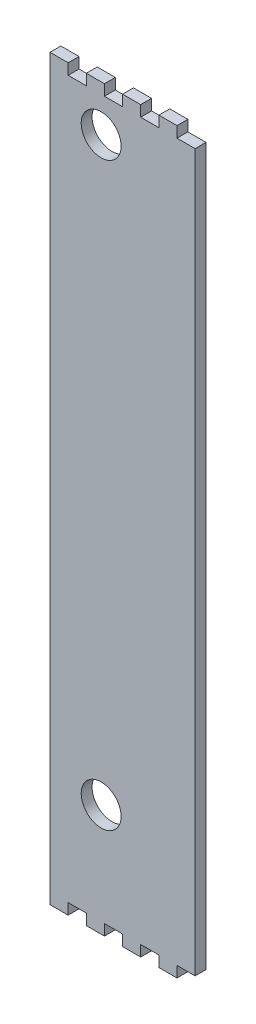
ISO-10303-21;
HEADER;
FILE_DESCRIPTION(('STEP AP214'),'2;1');
FILE_NAME('part.step','',(''),(''),'','','');
FILE_SCHEMA(('AUTOMOTIVE_DESIGN { 1 0 10303 214 1 1 1 1 }'));
ENDSEC;
DATA;
#1=APPLICATION_CONTEXT('core data for automotive mechanical design processes');
#2=APPLICATION_PROTOCOL_DEFINITION('international standard','automotive_design',2000,#1);
#3=PRODUCT_CONTEXT('',#1,'mechanical');
#4=PRODUCT('Part','Part','',(#3));
#5=PRODUCT_RELATED_PRODUCT_CATEGORY('part','',(#4));
#6=PRODUCT_DEFINITION_FORMATION('','',#4);
#7=PRODUCT_DEFINITION_CONTEXT('part definition',#1,'design');
#8=PRODUCT_DEFINITION('design','',#6,#7);
#9=PRODUCT_DEFINITION_SHAPE('','',#8);
#10=(LENGTH_UNIT() NAMED_UNIT(*) SI_UNIT(.MILLI.,.METRE.));
#11=(NAMED_UNIT(*) PLANE_ANGLE_UNIT() SI_UNIT($,.RADIAN.));
#12=(NAMED_UNIT(*) SI_UNIT($,.STERADIAN.) SOLID_ANGLE_UNIT());
#13=UNCERTAINTY_MEASURE_WITH_UNIT(LENGTH_MEASURE(1.E-05),#10,'distance_accuracy_value','');
#14=(GEOMETRIC_REPRESENTATION_CONTEXT(3) GLOBAL_UNCERTAINTY_ASSIGNED_CONTEXT((#13)) GLOBAL_UNIT_ASSIGNED_CONTEXT((#10,
#11,#12)) REPRESENTATION_CONTEXT('',''));
#15=CARTESIAN_POINT('',(0.,0.,0.));
#16=DIRECTION('',(0.,0.,1.));
#17=DIRECTION('',(1.,0.,0.));
#18=AXIS2_PLACEMENT_3D('',#15,#16,#17);
#19=CARTESIAN_POINT('',(-40.,203.5,6.));
#20=DIRECTION('',(1.,0.,0.));
#21=DIRECTION('',(0.,0.,-1.));
#22=AXIS2_PLACEMENT_3D('',#19,#20,#21);
#23=PLANE('',#22);
#24=DIRECTION('',(0.,-1.,0.));
#25=VECTOR('',#24,1.);
#26=CARTESIAN_POINT('',(-40.,203.5,0.));
#27=LINE('',#26,#25);
#28=CARTESIAN_POINT('',(-40.,203.5,0.));
#29=VERTEX_POINT('',#28);
#30=CARTESIAN_POINT('',(-40.,-203.5,0.));
#31=VERTEX_POINT('',#30);
#32=EDGE_CURVE('E273',#29,#31,#27,.T.);
#33=ORIENTED_EDGE('',*,*,#32,.T.);
#34=DIRECTION('',(0.,0.,-1.));
#35=VECTOR('',#34,1.);
#36=CARTESIAN_POINT('',(-40.,-203.5,6.));
#37=LINE('',#36,#35);
#38=CARTESIAN_POINT('',(-40.,-203.5,6.));
#39=VERTEX_POINT('',#38);
#40=EDGE_CURVE('E11',#39,#31,#37,.T.);
#41=ORIENTED_EDGE('',*,*,#40,.F.);
#42=DIRECTION('',(0.,-1.,0.));
#43=VECTOR('',#42,1.);
#44=CARTESIAN_POINT('',(-40.,203.5,6.));
#45=LINE('',#44,#43);
#46=CARTESIAN_POINT('',(-40.,203.5,6.));
#47=VERTEX_POINT('',#46);
#48=EDGE_CURVE('E336',#47,#39,#45,.T.);
#49=ORIENTED_EDGE('',*,*,#48,.F.);
#50=DIRECTION('',(0.,0.,-1.));
#51=VECTOR('',#50,1.);
#52=CARTESIAN_POINT('',(-40.,203.5,6.));
#53=LINE('',#52,#51);
#54=EDGE_CURVE('E269',#47,#29,#53,.T.);
#55=ORIENTED_EDGE('',*,*,#54,.T.);
#56=EDGE_LOOP('',(#33,#41,#49,#55));
#57=FACE_BOUND('',#56,.T.);
#58=ADVANCED_FACE('F33',(#57),#23,.F.);
#59=CARTESIAN_POINT('',(-40.,-203.5,6.));
#60=DIRECTION('',(0.,1.,0.));
#61=DIRECTION('',(0.,0.,1.));
#62=AXIS2_PLACEMENT_3D('',#59,#60,#61);
#63=PLANE('',#62);
#64=DIRECTION('',(1.,0.,0.));
#65=VECTOR('',#64,1.);
#66=CARTESIAN_POINT('',(-40.,-203.5,0.));
#67=LINE('',#66,#65);
#68=CARTESIAN_POINT('',(-30.,-203.5,0.));
#69=VERTEX_POINT('',#68);
#70=EDGE_CURVE('E276',#31,#69,#67,.T.);
#71=ORIENTED_EDGE('',*,*,#70,.T.);
#72=DIRECTION('',(0.,0.,-1.));
#73=VECTOR('',#72,1.);
#74=CARTESIAN_POINT('',(-30.,-203.5,6.));
#75=LINE('',#74,#73);
#76=CARTESIAN_POINT('',(-30.,-203.5,6.));
#77=VERTEX_POINT('',#76);
#78=EDGE_CURVE('E41',#77,#69,#75,.T.);
#79=ORIENTED_EDGE('',*,*,#78,.F.);
#80=DIRECTION('',(1.,0.,0.));
#81=VECTOR('',#80,1.);
#82=CARTESIAN_POINT('',(-40.,-203.5,6.));
#83=LINE('',#82,#81);
#84=EDGE_CURVE('E164',#39,#77,#83,.T.);
#85=ORIENTED_EDGE('',*,*,#84,.F.);
#86=ORIENTED_EDGE('',*,*,#40,.T.);
#87=EDGE_LOOP('',(#71,#79,#85,#86));
#88=FACE_BOUND('',#87,.T.);
#89=ADVANCED_FACE('F515',(#88),#63,.F.);
#90=CARTESIAN_POINT('',(-30.,-203.5,6.));
#91=DIRECTION('',(-1.,0.,0.));
#92=DIRECTION('',(0.,0.,1.));
#93=AXIS2_PLACEMENT_3D('',#90,#91,#92);
#94=PLANE('',#93);
#95=DIRECTION('',(0.,1.,0.));
#96=VECTOR('',#95,1.);
#97=CARTESIAN_POINT('',(-30.,-203.5,0.));
#98=LINE('',#97,#96);
#99=CARTESIAN_POINT('',(-30.,-197.5,0.));
#100=VERTEX_POINT('',#99);
#101=EDGE_CURVE('E279',#69,#100,#98,.T.);
#102=ORIENTED_EDGE('',*,*,#101,.T.);
#103=DIRECTION('',(0.,0.,-1.));
#104=VECTOR('',#103,1.);
#105=CARTESIAN_POINT('',(-30.,-197.5,6.));
#106=LINE('',#105,#104);
#107=CARTESIAN_POINT('',(-30.,-197.5,6.));
#108=VERTEX_POINT('',#107);
#109=EDGE_CURVE('E415',#108,#100,#106,.T.);
#110=ORIENTED_EDGE('',*,*,#109,.F.);
#111=DIRECTION('',(0.,1.,0.));
#112=VECTOR('',#111,1.);
#113=CARTESIAN_POINT('',(-30.,-203.5,6.));
#114=LINE('',#113,#112);
#115=EDGE_CURVE('E423',#77,#108,#114,.T.);
#116=ORIENTED_EDGE('',*,*,#115,.F.);
#117=ORIENTED_EDGE('',*,*,#78,.T.);
#118=EDGE_LOOP('',(#102,#110,#116,#117));
#119=FACE_BOUND('',#118,.T.);
#120=ADVANCED_FACE('F421',(#119),#94,.F.);
#121=CARTESIAN_POINT('',(-30.,-197.5,6.));
#122=DIRECTION('',(0.,1.,0.));
#123=DIRECTION('',(0.,0.,1.));
#124=AXIS2_PLACEMENT_3D('',#121,#122,#123);
#125=PLANE('',#124);
#126=DIRECTION('',(1.,0.,0.));
#127=VECTOR('',#126,1.);
#128=CARTESIAN_POINT('',(-30.,-197.5,0.));
#129=LINE('',#128,#127);
#130=CARTESIAN_POINT('',(-20.,-197.5,0.));
#131=VERTEX_POINT('',#130);
#132=EDGE_CURVE('E281',#100,#131,#129,.T.);
#133=ORIENTED_EDGE('',*,*,#132,.T.);
#134=DIRECTION('',(0.,0.,-1.));
#135=VECTOR('',#134,1.);
#136=CARTESIAN_POINT('',(-20.,-197.5,6.));
#137=LINE('',#136,#135);
#138=CARTESIAN_POINT('',(-20.,-197.5,6.));
#139=VERTEX_POINT('',#138);
#140=EDGE_CURVE('E412',#139,#131,#137,.T.);
#141=ORIENTED_EDGE('',*,*,#140,.F.);
#142=DIRECTION('',(1.,0.,0.));
#143=VECTOR('',#142,1.);
#144=CARTESIAN_POINT('',(-30.,-197.5,6.));
#145=LINE('',#144,#143);
#146=EDGE_CURVE('E441',#108,#139,#145,.T.);
#147=ORIENTED_EDGE('',*,*,#146,.F.);
#148=ORIENTED_EDGE('',*,*,#109,.T.);
#149=EDGE_LOOP('',(#133,#141,#147,#148));
#150=FACE_BOUND('',#149,.T.);
#151=ADVANCED_FACE('F432',(#150),#125,.F.);
#152=CARTESIAN_POINT('',(-20.,-203.5,6.));
#153=DIRECTION('',(1.,0.,0.));
#154=DIRECTION('',(0.,0.,-1.));
#155=AXIS2_PLACEMENT_3D('',#152,#153,#154);
#156=PLANE('',#155);
#157=DIRECTION('',(0.,-1.,0.));
#158=VECTOR('',#157,1.);
#159=CARTESIAN_POINT('',(-20.,-203.5,0.));
#160=LINE('',#159,#158);
#161=CARTESIAN_POINT('',(-20.,-203.5,0.));
#162=VERTEX_POINT('',#161);
#163=EDGE_CURVE('E283',#131,#162,#160,.T.);
#164=ORIENTED_EDGE('',*,*,#163,.T.);
#165=DIRECTION('',(0.,0.,-1.));
#166=VECTOR('',#165,1.);
#167=CARTESIAN_POINT('',(-20.,-203.5,6.));
#168=LINE('',#167,#166);
#169=CARTESIAN_POINT('',(-20.,-203.5,6.));
#170=VERTEX_POINT('',#169);
#171=EDGE_CURVE('E409',#170,#162,#168,.T.);
#172=ORIENTED_EDGE('',*,*,#171,.F.);
#173=DIRECTION('',(0.,-1.,0.));
#174=VECTOR('',#173,1.);
#175=CARTESIAN_POINT('',(-20.,-203.5,6.));
#176=LINE('',#175,#174);
#177=EDGE_CURVE('E438',#139,#170,#176,.T.);
#178=ORIENTED_EDGE('',*,*,#177,.F.);
#179=ORIENTED_EDGE('',*,*,#140,.T.);
#180=EDGE_LOOP('',(#164,#172,#178,#179));
#181=FACE_BOUND('',#180,.T.);
#182=ADVANCED_FACE('F436',(#181),#156,.F.);
#183=CARTESIAN_POINT('',(-20.,-203.5,6.));
#184=DIRECTION('',(0.,1.,0.));
#185=DIRECTION('',(0.,0.,1.));
#186=AXIS2_PLACEMENT_3D('',#183,#184,#185);
#187=PLANE('',#186);
#188=DIRECTION('',(1.,0.,0.));
#189=VECTOR('',#188,1.);
#190=CARTESIAN_POINT('',(-20.,-203.5,0.));
#191=LINE('',#190,#189);
#192=CARTESIAN_POINT('',(-10.,-203.5,0.));
#193=VERTEX_POINT('',#192);
#194=EDGE_CURVE('E285',#162,#193,#191,.T.);
#195=ORIENTED_EDGE('',*,*,#194,.T.);
#196=DIRECTION('',(0.,0.,-1.));
#197=VECTOR('',#196,1.);
#198=CARTESIAN_POINT('',(-10.,-203.5,6.));
#199=LINE('',#198,#197);
#200=CARTESIAN_POINT('',(-10.,-203.5,6.));
#201=VERTEX_POINT('',#200);
#202=EDGE_CURVE('E406',#201,#193,#199,.T.);
#203=ORIENTED_EDGE('',*,*,#202,.F.);
#204=DIRECTION('',(1.,0.,0.));
#205=VECTOR('',#204,1.);
#206=CARTESIAN_POINT('',(-20.,-203.5,6.));
#207=LINE('',#206,#205);
#208=EDGE_CURVE('E440',#170,#201,#207,.T.);
#209=ORIENTED_EDGE('',*,*,#208,.F.);
#210=ORIENTED_EDGE('',*,*,#171,.T.);
#211=EDGE_LOOP('',(#195,#203,#209,#210));
#212=FACE_BOUND('',#211,.T.);
#213=ADVANCED_FACE('F528',(#212),#187,.F.);
#214=CARTESIAN_POINT('',(-10.,-203.5,6.));
#215=DIRECTION('',(-1.,0.,0.));
#216=DIRECTION('',(0.,0.,1.));
#217=AXIS2_PLACEMENT_3D('',#214,#215,#216);
#218=PLANE('',#217);
#219=DIRECTION('',(0.,1.,0.));
#220=VECTOR('',#219,1.);
#221=CARTESIAN_POINT('',(-10.,-203.5,0.));
#222=LINE('',#221,#220);
#223=CARTESIAN_POINT('',(-10.,-197.5,0.));
#224=VERTEX_POINT('',#223);
#225=EDGE_CURVE('E287',#193,#224,#222,.T.);
#226=ORIENTED_EDGE('',*,*,#225,.T.);
#227=DIRECTION('',(0.,0.,-1.));
#228=VECTOR('',#227,1.);
#229=CARTESIAN_POINT('',(-10.,-197.5,6.));
#230=LINE('',#229,#228);
#231=CARTESIAN_POINT('',(-10.,-197.5,6.));
#232=VERTEX_POINT('',#231);
#233=EDGE_CURVE('E403',#232,#224,#230,.T.);
#234=ORIENTED_EDGE('',*,*,#233,.F.);
#235=DIRECTION('',(0.,1.,0.));
#236=VECTOR('',#235,1.);
#237=CARTESIAN_POINT('',(-10.,-203.5,6.));
#238=LINE('',#237,#236);
#239=EDGE_CURVE('E443',#201,#232,#238,.T.);
#240=ORIENTED_EDGE('',*,*,#239,.F.);
#241=ORIENTED_EDGE('',*,*,#202,.T.);
#242=EDGE_LOOP('',(#226,#234,#240,#241));
#243=FACE_BOUND('',#242,.T.);
#244=ADVANCED_FACE('F531',(#243),#218,.F.);
#245=CARTESIAN_POINT('',(-10.,-197.5,6.));
#246=DIRECTION('',(0.,1.,0.));
#247=DIRECTION('',(0.,0.,1.));
#248=AXIS2_PLACEMENT_3D('',#245,#246,#247);
#249=PLANE('',#248);
#250=DIRECTION('',(1.,0.,0.));
#251=VECTOR('',#250,1.);
#252=CARTESIAN_POINT('',(-10.,-197.5,0.));
#253=LINE('',#252,#251);
#254=CARTESIAN_POINT('',(0.,-197.5,0.));
#255=VERTEX_POINT('',#254);
#256=EDGE_CURVE('E289',#224,#255,#253,.T.);
#257=ORIENTED_EDGE('',*,*,#256,.T.);
#258=DIRECTION('',(0.,0.,-1.));
#259=VECTOR('',#258,1.);
#260=CARTESIAN_POINT('',(0.,-197.5,6.));
#261=LINE('',#260,#259);
#262=CARTESIAN_POINT('',(0.,-197.5,6.));
#263=VERTEX_POINT('',#262);
#264=EDGE_CURVE('E400',#263,#255,#261,.T.);
#265=ORIENTED_EDGE('',*,*,#264,.F.);
#266=DIRECTION('',(1.,0.,0.));
#267=VECTOR('',#266,1.);
#268=CARTESIAN_POINT('',(-10.,-197.5,6.));
#269=LINE('',#268,#267);
#270=EDGE_CURVE('E449',#232,#263,#269,.T.);
#271=ORIENTED_EDGE('',*,*,#270,.F.);
#272=ORIENTED_EDGE('',*,*,#233,.T.);
#273=EDGE_LOOP('',(#257,#265,#271,#272));
#274=FACE_BOUND('',#273,.T.);
#275=ADVANCED_FACE('F535',(#274),#249,.F.);
#276=CARTESIAN_POINT('',(0.,-203.5,6.));
#277=DIRECTION('',(1.,0.,0.));
#278=DIRECTION('',(0.,0.,-1.));
#279=AXIS2_PLACEMENT_3D('',#276,#277,#278);
#280=PLANE('',#279);
#281=DIRECTION('',(0.,-1.,0.));
#282=VECTOR('',#281,1.);
#283=CARTESIAN_POINT('',(0.,-203.5,0.));
#284=LINE('',#283,#282);
#285=CARTESIAN_POINT('',(0.,-203.5,0.));
#286=VERTEX_POINT('',#285);
#287=EDGE_CURVE('E291',#255,#286,#284,.T.);
#288=ORIENTED_EDGE('',*,*,#287,.T.);
#289=DIRECTION('',(0.,0.,-1.));
#290=VECTOR('',#289,1.);
#291=CARTESIAN_POINT('',(0.,-203.5,6.));
#292=LINE('',#291,#290);
#293=CARTESIAN_POINT('',(0.,-203.5,6.));
#294=VERTEX_POINT('',#293);
#295=EDGE_CURVE('E397',#294,#286,#292,.T.);
#296=ORIENTED_EDGE('',*,*,#295,.F.);
#297=DIRECTION('',(0.,-1.,0.));
#298=VECTOR('',#297,1.);
#299=CARTESIAN_POINT('',(0.,-203.5,6.));
#300=LINE('',#299,#298);
#301=EDGE_CURVE('E451',#263,#294,#300,.T.);
#302=ORIENTED_EDGE('',*,*,#301,.F.);
#303=ORIENTED_EDGE('',*,*,#264,.T.);
#304=EDGE_LOOP('',(#288,#296,#302,#303));
#305=FACE_BOUND('',#304,.T.);
#306=ADVANCED_FACE('F539',(#305),#280,.F.);
#307=CARTESIAN_POINT('',(0.,-203.5,6.));
#308=DIRECTION('',(0.,1.,0.));
#309=DIRECTION('',(0.,0.,1.));
#310=AXIS2_PLACEMENT_3D('',#307,#308,#309);
#311=PLANE('',#310);
#312=DIRECTION('',(1.,0.,0.));
#313=VECTOR('',#312,1.);
#314=CARTESIAN_POINT('',(0.,-203.5,0.));
#315=LINE('',#314,#313);
#316=CARTESIAN_POINT('',(9.99999999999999,-203.5,0.));
#317=VERTEX_POINT('',#316);
#318=EDGE_CURVE('E293',#286,#317,#315,.T.);
#319=ORIENTED_EDGE('',*,*,#318,.T.);
#320=DIRECTION('',(0.,0.,-1.));
#321=VECTOR('',#320,1.);
#322=CARTESIAN_POINT('',(9.99999999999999,-203.5,6.));
#323=LINE('',#322,#321);
#324=CARTESIAN_POINT('',(9.99999999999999,-203.5,6.));
#325=VERTEX_POINT('',#324);
#326=EDGE_CURVE('E394',#325,#317,#323,.T.);
#327=ORIENTED_EDGE('',*,*,#326,.F.);
#328=DIRECTION('',(1.,0.,0.));
#329=VECTOR('',#328,1.);
#330=CARTESIAN_POINT('',(0.,-203.5,6.));
#331=LINE('',#330,#329);
#332=EDGE_CURVE('E453',#294,#325,#331,.T.);
#333=ORIENTED_EDGE('',*,*,#332,.F.);
#334=ORIENTED_EDGE('',*,*,#295,.T.);
#335=EDGE_LOOP('',(#319,#327,#333,#334));
#336=FACE_BOUND('',#335,.T.);
#337=ADVANCED_FACE('F543',(#336),#311,.F.);
#338=CARTESIAN_POINT('',(9.99999999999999,-203.5,6.));
#339=DIRECTION('',(-1.,0.,0.));
#340=DIRECTION('',(0.,0.,1.));
#341=AXIS2_PLACEMENT_3D('',#338,#339,#340);
#342=PLANE('',#341);
#343=DIRECTION('',(0.,1.,0.));
#344=VECTOR('',#343,1.);
#345=CARTESIAN_POINT('',(9.99999999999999,-203.5,0.));
#346=LINE('',#345,#344);
#347=CARTESIAN_POINT('',(9.99999999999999,-197.5,0.));
#348=VERTEX_POINT('',#347);
#349=EDGE_CURVE('E295',#317,#348,#346,.T.);
#350=ORIENTED_EDGE('',*,*,#349,.T.);
#351=DIRECTION('',(0.,0.,-1.));
#352=VECTOR('',#351,1.);
#353=CARTESIAN_POINT('',(9.99999999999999,-197.5,6.));
#354=LINE('',#353,#352);
#355=CARTESIAN_POINT('',(9.99999999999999,-197.5,6.));
#356=VERTEX_POINT('',#355);
#357=EDGE_CURVE('E391',#356,#348,#354,.T.);
#358=ORIENTED_EDGE('',*,*,#357,.F.);
#359=DIRECTION('',(0.,1.,0.));
#360=VECTOR('',#359,1.);
#361=CARTESIAN_POINT('',(9.99999999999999,-203.5,6.));
#362=LINE('',#361,#360);
#363=EDGE_CURVE('E455',#325,#356,#362,.T.);
#364=ORIENTED_EDGE('',*,*,#363,.F.);
#365=ORIENTED_EDGE('',*,*,#326,.T.);
#366=EDGE_LOOP('',(#350,#358,#364,#365));
#367=FACE_BOUND('',#366,.T.);
#368=ADVANCED_FACE('F547',(#367),#342,.F.);
#369=CARTESIAN_POINT('',(9.99999999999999,-197.5,6.));
#370=DIRECTION('',(0.,1.,0.));
#371=DIRECTION('',(0.,0.,1.));
#372=AXIS2_PLACEMENT_3D('',#369,#370,#371);
#373=PLANE('',#372);
#374=DIRECTION('',(1.,0.,0.));
#375=VECTOR('',#374,1.);
#376=CARTESIAN_POINT('',(9.99999999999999,-197.5,0.));
#377=LINE('',#376,#375);
#378=CARTESIAN_POINT('',(20.,-197.5,0.));
#379=VERTEX_POINT('',#378);
#380=EDGE_CURVE('E297',#348,#379,#377,.T.);
#381=ORIENTED_EDGE('',*,*,#380,.T.);
#382=DIRECTION('',(0.,0.,-1.));
#383=VECTOR('',#382,1.);
#384=CARTESIAN_POINT('',(20.,-197.5,6.));
#385=LINE('',#384,#383);
#386=CARTESIAN_POINT('',(20.,-197.5,6.));
#387=VERTEX_POINT('',#386);
#388=EDGE_CURVE('E388',#387,#379,#385,.T.);
#389=ORIENTED_EDGE('',*,*,#388,.F.);
#390=DIRECTION('',(1.,0.,0.));
#391=VECTOR('',#390,1.);
#392=CARTESIAN_POINT('',(9.99999999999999,-197.5,6.));
#393=LINE('',#392,#391);
#394=EDGE_CURVE('E457',#356,#387,#393,.T.);
#395=ORIENTED_EDGE('',*,*,#394,.F.);
#396=ORIENTED_EDGE('',*,*,#357,.T.);
#397=EDGE_LOOP('',(#381,#389,#395,#396));
#398=FACE_BOUND('',#397,.T.);
#399=ADVANCED_FACE('F551',(#398),#373,.F.);
#400=CARTESIAN_POINT('',(20.,-203.5,6.));
#401=DIRECTION('',(1.,0.,0.));
#402=DIRECTION('',(0.,0.,-1.));
#403=AXIS2_PLACEMENT_3D('',#400,#401,#402);
#404=PLANE('',#403);
#405=DIRECTION('',(0.,-1.,0.));
#406=VECTOR('',#405,1.);
#407=CARTESIAN_POINT('',(20.,-203.5,0.));
#408=LINE('',#407,#406);
#409=CARTESIAN_POINT('',(20.,-203.5,0.));
#410=VERTEX_POINT('',#409);
#411=EDGE_CURVE('E299',#379,#410,#408,.T.);
#412=ORIENTED_EDGE('',*,*,#411,.T.);
#413=DIRECTION('',(0.,0.,-1.));
#414=VECTOR('',#413,1.);
#415=CARTESIAN_POINT('',(20.,-203.5,6.));
#416=LINE('',#415,#414);
#417=CARTESIAN_POINT('',(20.,-203.5,6.));
#418=VERTEX_POINT('',#417);
#419=EDGE_CURVE('E385',#418,#410,#416,.T.);
#420=ORIENTED_EDGE('',*,*,#419,.F.);
#421=DIRECTION('',(0.,-1.,0.));
#422=VECTOR('',#421,1.);
#423=CARTESIAN_POINT('',(20.,-203.5,6.));
#424=LINE('',#423,#422);
#425=EDGE_CURVE('E459',#387,#418,#424,.T.);
#426=ORIENTED_EDGE('',*,*,#425,.F.);
#427=ORIENTED_EDGE('',*,*,#388,.T.);
#428=EDGE_LOOP('',(#412,#420,#426,#427));
#429=FACE_BOUND('',#428,.T.);
#430=ADVANCED_FACE('F555',(#429),#404,.F.);
#431=CARTESIAN_POINT('',(20.,-203.5,6.));
#432=DIRECTION('',(0.,1.,0.));
#433=DIRECTION('',(0.,0.,1.));
#434=AXIS2_PLACEMENT_3D('',#431,#432,#433);
#435=PLANE('',#434);
#436=DIRECTION('',(1.,0.,0.));
#437=VECTOR('',#436,1.);
#438=CARTESIAN_POINT('',(20.,-203.5,0.));
#439=LINE('',#438,#437);
#440=CARTESIAN_POINT('',(30.,-203.5,0.));
#441=VERTEX_POINT('',#440);
#442=EDGE_CURVE('E301',#410,#441,#439,.T.);
#443=ORIENTED_EDGE('',*,*,#442,.T.);
#444=DIRECTION('',(0.,0.,-1.));
#445=VECTOR('',#444,1.);
#446=CARTESIAN_POINT('',(30.,-203.5,6.));
#447=LINE('',#446,#445);
#448=CARTESIAN_POINT('',(30.,-203.5,6.));
#449=VERTEX_POINT('',#448);
#450=EDGE_CURVE('E382',#449,#441,#447,.T.);
#451=ORIENTED_EDGE('',*,*,#450,.F.);
#452=DIRECTION('',(1.,0.,0.));
#453=VECTOR('',#452,1.);
#454=CARTESIAN_POINT('',(20.,-203.5,6.));
#455=LINE('',#454,#453);
#456=EDGE_CURVE('E461',#418,#449,#455,.T.);
#457=ORIENTED_EDGE('',*,*,#456,.F.);
#458=ORIENTED_EDGE('',*,*,#419,.T.);
#459=EDGE_LOOP('',(#443,#451,#457,#458));
#460=FACE_BOUND('',#459,.T.);
#461=ADVANCED_FACE('F559',(#460),#435,.F.);
#462=CARTESIAN_POINT('',(30.,-203.5,6.));
#463=DIRECTION('',(-1.,0.,0.));
#464=DIRECTION('',(0.,0.,1.));
#465=AXIS2_PLACEMENT_3D('',#462,#463,#464);
#466=PLANE('',#465);
#467=DIRECTION('',(0.,1.,0.));
#468=VECTOR('',#467,1.);
#469=CARTESIAN_POINT('',(30.,-203.5,0.));
#470=LINE('',#469,#468);
#471=CARTESIAN_POINT('',(30.,-197.5,0.));
#472=VERTEX_POINT('',#471);
#473=EDGE_CURVE('E303',#441,#472,#470,.T.);
#474=ORIENTED_EDGE('',*,*,#473,.T.);
#475=DIRECTION('',(0.,0.,-1.));
#476=VECTOR('',#475,1.);
#477=CARTESIAN_POINT('',(30.,-197.5,6.));
#478=LINE('',#477,#476);
#479=CARTESIAN_POINT('',(30.,-197.5,6.));
#480=VERTEX_POINT('',#479);
#481=EDGE_CURVE('E379',#480,#472,#478,.T.);
#482=ORIENTED_EDGE('',*,*,#481,.F.);
#483=DIRECTION('',(0.,1.,0.));
#484=VECTOR('',#483,1.);
#485=CARTESIAN_POINT('',(30.,-203.5,6.));
#486=LINE('',#485,#484);
#487=EDGE_CURVE('E463',#449,#480,#486,.T.);
#488=ORIENTED_EDGE('',*,*,#487,.F.);
#489=ORIENTED_EDGE('',*,*,#450,.T.);
#490=EDGE_LOOP('',(#474,#482,#488,#489));
#491=FACE_BOUND('',#490,.T.);
#492=ADVANCED_FACE('F563',(#491),#466,.F.);
#493=CARTESIAN_POINT('',(30.,-197.5,6.));
#494=DIRECTION('',(0.,1.,0.));
#495=DIRECTION('',(0.,0.,1.));
#496=AXIS2_PLACEMENT_3D('',#493,#494,#495);
#497=PLANE('',#496);
#498=DIRECTION('',(1.,0.,0.));
#499=VECTOR('',#498,1.);
#500=CARTESIAN_POINT('',(30.,-197.5,0.));
#501=LINE('',#500,#499);
#502=CARTESIAN_POINT('',(40.,-197.5,0.));
#503=VERTEX_POINT('',#502);
#504=EDGE_CURVE('E305',#472,#503,#501,.T.);
#505=ORIENTED_EDGE('',*,*,#504,.T.);
#506=DIRECTION('',(0.,0.,-1.));
#507=VECTOR('',#506,1.);
#508=CARTESIAN_POINT('',(40.,-197.5,6.));
#509=LINE('',#508,#507);
#510=CARTESIAN_POINT('',(40.,-197.5,6.));
#511=VERTEX_POINT('',#510);
#512=EDGE_CURVE('E376',#511,#503,#509,.T.);
#513=ORIENTED_EDGE('',*,*,#512,.F.);
#514=DIRECTION('',(1.,0.,0.));
#515=VECTOR('',#514,1.);
#516=CARTESIAN_POINT('',(30.,-197.5,6.));
#517=LINE('',#516,#515);
#518=EDGE_CURVE('E465',#480,#511,#517,.T.);
#519=ORIENTED_EDGE('',*,*,#518,.F.);
#520=ORIENTED_EDGE('',*,*,#481,.T.);
#521=EDGE_LOOP('',(#505,#513,#519,#520));
#522=FACE_BOUND('',#521,.T.);
#523=ADVANCED_FACE('F567',(#522),#497,.F.);
#524=CARTESIAN_POINT('',(40.,197.5,6.));
#525=DIRECTION('',(-1.,0.,0.));
#526=DIRECTION('',(0.,0.,1.));
#527=AXIS2_PLACEMENT_3D('',#524,#525,#526);
#528=PLANE('',#527);
#529=DIRECTION('',(0.,1.,0.));
#530=VECTOR('',#529,1.);
#531=CARTESIAN_POINT('',(40.,197.5,0.));
#532=LINE('',#531,#530);
#533=CARTESIAN_POINT('',(40.,197.5,0.));
#534=VERTEX_POINT('',#533);
#535=EDGE_CURVE('E307',#503,#534,#532,.T.);
#536=ORIENTED_EDGE('',*,*,#535,.T.);
#537=DIRECTION('',(0.,0.,-1.));
#538=VECTOR('',#537,1.);
#539=CARTESIAN_POINT('',(40.,197.5,6.));
#540=LINE('',#539,#538);
#541=CARTESIAN_POINT('',(40.,197.5,6.));
#542=VERTEX_POINT('',#541);
#543=EDGE_CURVE('E373',#542,#534,#540,.T.);
#544=ORIENTED_EDGE('',*,*,#543,.F.);
#545=DIRECTION('',(0.,1.,0.));
#546=VECTOR('',#545,1.);
#547=CARTESIAN_POINT('',(40.,197.5,6.));
#548=LINE('',#547,#546);
#549=EDGE_CURVE('E467',#511,#542,#548,.T.);
#550=ORIENTED_EDGE('',*,*,#549,.F.);
#551=ORIENTED_EDGE('',*,*,#512,.T.);
#552=EDGE_LOOP('',(#536,#544,#550,#551));
#553=FACE_BOUND('',#552,.T.);
#554=ADVANCED_FACE('F571',(#553),#528,.F.);
#555=CARTESIAN_POINT('',(30.,197.5,6.));
#556=DIRECTION('',(0.,-1.,0.));
#557=DIRECTION('',(0.,0.,-1.));
#558=AXIS2_PLACEMENT_3D('',#555,#556,#557);
#559=PLANE('',#558);
#560=DIRECTION('',(-1.,0.,0.));
#561=VECTOR('',#560,1.);
#562=CARTESIAN_POINT('',(30.,197.5,0.));
#563=LINE('',#562,#561);
#564=CARTESIAN_POINT('',(30.,197.5,0.));
#565=VERTEX_POINT('',#564);
#566=EDGE_CURVE('E309',#534,#565,#563,.T.);
#567=ORIENTED_EDGE('',*,*,#566,.T.);
#568=DIRECTION('',(0.,0.,-1.));
#569=VECTOR('',#568,1.);
#570=CARTESIAN_POINT('',(30.,197.5,6.));
#571=LINE('',#570,#569);
#572=CARTESIAN_POINT('',(30.,197.5,6.));
#573=VERTEX_POINT('',#572);
#574=EDGE_CURVE('E370',#573,#565,#571,.T.);
#575=ORIENTED_EDGE('',*,*,#574,.F.);
#576=DIRECTION('',(-1.,0.,0.));
#577=VECTOR('',#576,1.);
#578=CARTESIAN_POINT('',(30.,197.5,6.));
#579=LINE('',#578,#577);
#580=EDGE_CURVE('E469',#542,#573,#579,.T.);
#581=ORIENTED_EDGE('',*,*,#580,.F.);
#582=ORIENTED_EDGE('',*,*,#543,.T.);
#583=EDGE_LOOP('',(#567,#575,#581,#582));
#584=FACE_BOUND('',#583,.T.);
#585=ADVANCED_FACE('F575',(#584),#559,.F.);
#586=CARTESIAN_POINT('',(30.,203.5,6.));
#587=DIRECTION('',(-1.,0.,0.));
#588=DIRECTION('',(0.,0.,1.));
#589=AXIS2_PLACEMENT_3D('',#586,#587,#588);
#590=PLANE('',#589);
#591=DIRECTION('',(0.,1.,0.));
#592=VECTOR('',#591,1.);
#593=CARTESIAN_POINT('',(30.,203.5,0.));
#594=LINE('',#593,#592);
#595=CARTESIAN_POINT('',(30.,203.5,0.));
#596=VERTEX_POINT('',#595);
#597=EDGE_CURVE('E311',#565,#596,#594,.T.);
#598=ORIENTED_EDGE('',*,*,#597,.T.);
#599=DIRECTION('',(0.,0.,-1.));
#600=VECTOR('',#599,1.);
#601=CARTESIAN_POINT('',(30.,203.5,6.));
#602=LINE('',#601,#600);
#603=CARTESIAN_POINT('',(30.,203.5,6.));
#604=VERTEX_POINT('',#603);
#605=EDGE_CURVE('E367',#604,#596,#602,.T.);
#606=ORIENTED_EDGE('',*,*,#605,.F.);
#607=DIRECTION('',(0.,1.,0.));
#608=VECTOR('',#607,1.);
#609=CARTESIAN_POINT('',(30.,203.5,6.));
#610=LINE('',#609,#608);
#611=EDGE_CURVE('E471',#573,#604,#610,.T.);
#612=ORIENTED_EDGE('',*,*,#611,.F.);
#613=ORIENTED_EDGE('',*,*,#574,.T.);
#614=EDGE_LOOP('',(#598,#606,#612,#613));
#615=FACE_BOUND('',#614,.T.);
#616=ADVANCED_FACE('F579',(#615),#590,.F.);
#617=CARTESIAN_POINT('',(20.,203.5,6.));
#618=DIRECTION('',(0.,-1.,0.));
#619=DIRECTION('',(0.,0.,-1.));
#620=AXIS2_PLACEMENT_3D('',#617,#618,#619);
#621=PLANE('',#620);
#622=DIRECTION('',(-1.,0.,0.));
#623=VECTOR('',#622,1.);
#624=CARTESIAN_POINT('',(20.,203.5,0.));
#625=LINE('',#624,#623);
#626=CARTESIAN_POINT('',(20.,203.5,0.));
#627=VERTEX_POINT('',#626);
#628=EDGE_CURVE('E313',#596,#627,#625,.T.);
#629=ORIENTED_EDGE('',*,*,#628,.T.);
#630=DIRECTION('',(0.,0.,-1.));
#631=VECTOR('',#630,1.);
#632=CARTESIAN_POINT('',(20.,203.5,6.));
#633=LINE('',#632,#631);
#634=CARTESIAN_POINT('',(20.,203.5,6.));
#635=VERTEX_POINT('',#634);
#636=EDGE_CURVE('E364',#635,#627,#633,.T.);
#637=ORIENTED_EDGE('',*,*,#636,.F.);
#638=DIRECTION('',(-1.,0.,0.));
#639=VECTOR('',#638,1.);
#640=CARTESIAN_POINT('',(20.,203.5,6.));
#641=LINE('',#640,#639);
#642=EDGE_CURVE('E473',#604,#635,#641,.T.);
#643=ORIENTED_EDGE('',*,*,#642,.F.);
#644=ORIENTED_EDGE('',*,*,#605,.T.);
#645=EDGE_LOOP('',(#629,#637,#643,#644));
#646=FACE_BOUND('',#645,.T.);
#647=ADVANCED_FACE('F583',(#646),#621,.F.);
#648=CARTESIAN_POINT('',(20.,203.5,6.));
#649=DIRECTION('',(1.,0.,0.));
#650=DIRECTION('',(0.,0.,-1.));
#651=AXIS2_PLACEMENT_3D('',#648,#649,#650);
#652=PLANE('',#651);
#653=DIRECTION('',(0.,-1.,0.));
#654=VECTOR('',#653,1.);
#655=CARTESIAN_POINT('',(20.,203.5,0.));
#656=LINE('',#655,#654);
#657=CARTESIAN_POINT('',(20.,197.5,0.));
#658=VERTEX_POINT('',#657);
#659=EDGE_CURVE('E315',#627,#658,#656,.T.);
#660=ORIENTED_EDGE('',*,*,#659,.T.);
#661=DIRECTION('',(0.,0.,-1.));
#662=VECTOR('',#661,1.);
#663=CARTESIAN_POINT('',(20.,197.5,6.));
#664=LINE('',#663,#662);
#665=CARTESIAN_POINT('',(20.,197.5,6.));
#666=VERTEX_POINT('',#665);
#667=EDGE_CURVE('E361',#666,#658,#664,.T.);
#668=ORIENTED_EDGE('',*,*,#667,.F.);
#669=DIRECTION('',(0.,-1.,0.));
#670=VECTOR('',#669,1.);
#671=CARTESIAN_POINT('',(20.,203.5,6.));
#672=LINE('',#671,#670);
#673=EDGE_CURVE('E475',#635,#666,#672,.T.);
#674=ORIENTED_EDGE('',*,*,#673,.F.);
#675=ORIENTED_EDGE('',*,*,#636,.T.);
#676=EDGE_LOOP('',(#660,#668,#674,#675));
#677=FACE_BOUND('',#676,.T.);
#678=ADVANCED_FACE('F587',(#677),#652,.F.);
#679=CARTESIAN_POINT('',(9.99999999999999,197.5,6.));
#680=DIRECTION('',(0.,-1.,0.));
#681=DIRECTION('',(0.,0.,-1.));
#682=AXIS2_PLACEMENT_3D('',#679,#680,#681);
#683=PLANE('',#682);
#684=DIRECTION('',(-1.,0.,0.));
#685=VECTOR('',#684,1.);
#686=CARTESIAN_POINT('',(9.99999999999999,197.5,0.));
#687=LINE('',#686,#685);
#688=CARTESIAN_POINT('',(9.99999999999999,197.5,0.));
#689=VERTEX_POINT('',#688);
#690=EDGE_CURVE('E317',#658,#689,#687,.T.);
#691=ORIENTED_EDGE('',*,*,#690,.T.);
#692=DIRECTION('',(0.,0.,-1.));
#693=VECTOR('',#692,1.);
#694=CARTESIAN_POINT('',(9.99999999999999,197.5,6.));
#695=LINE('',#694,#693);
#696=CARTESIAN_POINT('',(9.99999999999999,197.5,6.));
#697=VERTEX_POINT('',#696);
#698=EDGE_CURVE('E358',#697,#689,#695,.T.);
#699=ORIENTED_EDGE('',*,*,#698,.F.);
#700=DIRECTION('',(-1.,0.,0.));
#701=VECTOR('',#700,1.);
#702=CARTESIAN_POINT('',(9.99999999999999,197.5,6.));
#703=LINE('',#702,#701);
#704=EDGE_CURVE('E477',#666,#697,#703,.T.);
#705=ORIENTED_EDGE('',*,*,#704,.F.);
#706=ORIENTED_EDGE('',*,*,#667,.T.);
#707=EDGE_LOOP('',(#691,#699,#705,#706));
#708=FACE_BOUND('',#707,.T.);
#709=ADVANCED_FACE('F591',(#708),#683,.F.);
#710=CARTESIAN_POINT('',(9.99999999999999,203.5,6.));
#711=DIRECTION('',(-1.,0.,0.));
#712=DIRECTION('',(0.,0.,1.));
#713=AXIS2_PLACEMENT_3D('',#710,#711,#712);
#714=PLANE('',#713);
#715=DIRECTION('',(0.,1.,0.));
#716=VECTOR('',#715,1.);
#717=CARTESIAN_POINT('',(9.99999999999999,203.5,0.));
#718=LINE('',#717,#716);
#719=CARTESIAN_POINT('',(9.99999999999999,203.5,0.));
#720=VERTEX_POINT('',#719);
#721=EDGE_CURVE('E319',#689,#720,#718,.T.);
#722=ORIENTED_EDGE('',*,*,#721,.T.);
#723=DIRECTION('',(0.,0.,-1.));
#724=VECTOR('',#723,1.);
#725=CARTESIAN_POINT('',(9.99999999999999,203.5,6.));
#726=LINE('',#725,#724);
#727=CARTESIAN_POINT('',(9.99999999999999,203.5,6.));
#728=VERTEX_POINT('',#727);
#729=EDGE_CURVE('E355',#728,#720,#726,.T.);
#730=ORIENTED_EDGE('',*,*,#729,.F.);
#731=DIRECTION('',(0.,1.,0.));
#732=VECTOR('',#731,1.);
#733=CARTESIAN_POINT('',(9.99999999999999,203.5,6.));
#734=LINE('',#733,#732);
#735=EDGE_CURVE('E479',#697,#728,#734,.T.);
#736=ORIENTED_EDGE('',*,*,#735,.F.);
#737=ORIENTED_EDGE('',*,*,#698,.T.);
#738=EDGE_LOOP('',(#722,#730,#736,#737));
#739=FACE_BOUND('',#738,.T.);
#740=ADVANCED_FACE('F595',(#739),#714,.F.);
#741=CARTESIAN_POINT('',(0.,203.5,6.));
#742=DIRECTION('',(0.,-1.,0.));
#743=DIRECTION('',(0.,0.,-1.));
#744=AXIS2_PLACEMENT_3D('',#741,#742,#743);
#745=PLANE('',#744);
#746=DIRECTION('',(-1.,0.,0.));
#747=VECTOR('',#746,1.);
#748=CARTESIAN_POINT('',(0.,203.5,0.));
#749=LINE('',#748,#747);
#750=CARTESIAN_POINT('',(0.,203.5,0.));
#751=VERTEX_POINT('',#750);
#752=EDGE_CURVE('E321',#720,#751,#749,.T.);
#753=ORIENTED_EDGE('',*,*,#752,.T.);
#754=DIRECTION('',(0.,0.,-1.));
#755=VECTOR('',#754,1.);
#756=CARTESIAN_POINT('',(0.,203.5,6.));
#757=LINE('',#756,#755);
#758=CARTESIAN_POINT('',(0.,203.5,6.));
#759=VERTEX_POINT('',#758);
#760=EDGE_CURVE('E352',#759,#751,#757,.T.);
#761=ORIENTED_EDGE('',*,*,#760,.F.);
#762=DIRECTION('',(-1.,0.,0.));
#763=VECTOR('',#762,1.);
#764=CARTESIAN_POINT('',(0.,203.5,6.));
#765=LINE('',#764,#763);
#766=EDGE_CURVE('E481',#728,#759,#765,.T.);
#767=ORIENTED_EDGE('',*,*,#766,.F.);
#768=ORIENTED_EDGE('',*,*,#729,.T.);
#769=EDGE_LOOP('',(#753,#761,#767,#768));
#770=FACE_BOUND('',#769,.T.);
#771=ADVANCED_FACE('F599',(#770),#745,.F.);
#772=CARTESIAN_POINT('',(0.,203.5,6.));
#773=DIRECTION('',(1.,0.,0.));
#774=DIRECTION('',(0.,0.,-1.));
#775=AXIS2_PLACEMENT_3D('',#772,#773,#774);
#776=PLANE('',#775);
#777=DIRECTION('',(0.,-1.,0.));
#778=VECTOR('',#777,1.);
#779=CARTESIAN_POINT('',(0.,203.5,0.));
#780=LINE('',#779,#778);
#781=CARTESIAN_POINT('',(0.,197.5,0.));
#782=VERTEX_POINT('',#781);
#783=EDGE_CURVE('E323',#751,#782,#780,.T.);
#784=ORIENTED_EDGE('',*,*,#783,.T.);
#785=DIRECTION('',(0.,0.,-1.));
#786=VECTOR('',#785,1.);
#787=CARTESIAN_POINT('',(0.,197.5,6.));
#788=LINE('',#787,#786);
#789=CARTESIAN_POINT('',(0.,197.5,6.));
#790=VERTEX_POINT('',#789);
#791=EDGE_CURVE('E349',#790,#782,#788,.T.);
#792=ORIENTED_EDGE('',*,*,#791,.F.);
#793=DIRECTION('',(0.,-1.,0.));
#794=VECTOR('',#793,1.);
#795=CARTESIAN_POINT('',(0.,203.5,6.));
#796=LINE('',#795,#794);
#797=EDGE_CURVE('E483',#759,#790,#796,.T.);
#798=ORIENTED_EDGE('',*,*,#797,.F.);
#799=ORIENTED_EDGE('',*,*,#760,.T.);
#800=EDGE_LOOP('',(#784,#792,#798,#799));
#801=FACE_BOUND('',#800,.T.);
#802=ADVANCED_FACE('F603',(#801),#776,.F.);
#803=CARTESIAN_POINT('',(-10.,197.5,6.));
#804=DIRECTION('',(0.,-1.,0.));
#805=DIRECTION('',(0.,0.,-1.));
#806=AXIS2_PLACEMENT_3D('',#803,#804,#805);
#807=PLANE('',#806);
#808=DIRECTION('',(-1.,0.,0.));
#809=VECTOR('',#808,1.);
#810=CARTESIAN_POINT('',(-10.,197.5,0.));
#811=LINE('',#810,#809);
#812=CARTESIAN_POINT('',(-10.,197.5,0.));
#813=VERTEX_POINT('',#812);
#814=EDGE_CURVE('E325',#782,#813,#811,.T.);
#815=ORIENTED_EDGE('',*,*,#814,.T.);
#816=DIRECTION('',(0.,0.,-1.));
#817=VECTOR('',#816,1.);
#818=CARTESIAN_POINT('',(-10.,197.5,6.));
#819=LINE('',#818,#817);
#820=CARTESIAN_POINT('',(-10.,197.5,6.));
#821=VERTEX_POINT('',#820);
#822=EDGE_CURVE('E346',#821,#813,#819,.T.);
#823=ORIENTED_EDGE('',*,*,#822,.F.);
#824=DIRECTION('',(-1.,0.,0.));
#825=VECTOR('',#824,1.);
#826=CARTESIAN_POINT('',(-10.,197.5,6.));
#827=LINE('',#826,#825);
#828=EDGE_CURVE('E485',#790,#821,#827,.T.);
#829=ORIENTED_EDGE('',*,*,#828,.F.);
#830=ORIENTED_EDGE('',*,*,#791,.T.);
#831=EDGE_LOOP('',(#815,#823,#829,#830));
#832=FACE_BOUND('',#831,.T.);
#833=ADVANCED_FACE('F607',(#832),#807,.F.);
#834=CARTESIAN_POINT('',(-10.,203.5,6.));
#835=DIRECTION('',(-1.,0.,0.));
#836=DIRECTION('',(0.,0.,1.));
#837=AXIS2_PLACEMENT_3D('',#834,#835,#836);
#838=PLANE('',#837);
#839=DIRECTION('',(0.,1.,0.));
#840=VECTOR('',#839,1.);
#841=CARTESIAN_POINT('',(-10.,203.5,0.));
#842=LINE('',#841,#840);
#843=CARTESIAN_POINT('',(-10.,203.5,0.));
#844=VERTEX_POINT('',#843);
#845=EDGE_CURVE('E327',#813,#844,#842,.T.);
#846=ORIENTED_EDGE('',*,*,#845,.T.);
#847=DIRECTION('',(0.,0.,-1.));
#848=VECTOR('',#847,1.);
#849=CARTESIAN_POINT('',(-10.,203.5,6.));
#850=LINE('',#849,#848);
#851=CARTESIAN_POINT('',(-10.,203.5,6.));
#852=VERTEX_POINT('',#851);
#853=EDGE_CURVE('E343',#852,#844,#850,.T.);
#854=ORIENTED_EDGE('',*,*,#853,.F.);
#855=DIRECTION('',(0.,1.,0.));
#856=VECTOR('',#855,1.);
#857=CARTESIAN_POINT('',(-10.,203.5,6.));
#858=LINE('',#857,#856);
#859=EDGE_CURVE('E487',#821,#852,#858,.T.);
#860=ORIENTED_EDGE('',*,*,#859,.F.);
#861=ORIENTED_EDGE('',*,*,#822,.T.);
#862=EDGE_LOOP('',(#846,#854,#860,#861));
#863=FACE_BOUND('',#862,.T.);
#864=ADVANCED_FACE('F611',(#863),#838,.F.);
#865=CARTESIAN_POINT('',(-20.,203.5,6.));
#866=DIRECTION('',(0.,-1.,0.));
#867=DIRECTION('',(0.,0.,-1.));
#868=AXIS2_PLACEMENT_3D('',#865,#866,#867);
#869=PLANE('',#868);
#870=DIRECTION('',(-1.,0.,0.));
#871=VECTOR('',#870,1.);
#872=CARTESIAN_POINT('',(-20.,203.5,0.));
#873=LINE('',#872,#871);
#874=CARTESIAN_POINT('',(-20.,203.5,0.));
#875=VERTEX_POINT('',#874);
#876=EDGE_CURVE('E329',#844,#875,#873,.T.);
#877=ORIENTED_EDGE('',*,*,#876,.T.);
#878=DIRECTION('',(0.,0.,-1.));
#879=VECTOR('',#878,1.);
#880=CARTESIAN_POINT('',(-20.,203.5,6.));
#881=LINE('',#880,#879);
#882=CARTESIAN_POINT('',(-20.,203.5,6.));
#883=VERTEX_POINT('',#882);
#884=EDGE_CURVE('E340',#883,#875,#881,.T.);
#885=ORIENTED_EDGE('',*,*,#884,.F.);
#886=DIRECTION('',(-1.,0.,0.));
#887=VECTOR('',#886,1.);
#888=CARTESIAN_POINT('',(-20.,203.5,6.));
#889=LINE('',#888,#887);
#890=EDGE_CURVE('E489',#852,#883,#889,.T.);
#891=ORIENTED_EDGE('',*,*,#890,.F.);
#892=ORIENTED_EDGE('',*,*,#853,.T.);
#893=EDGE_LOOP('',(#877,#885,#891,#892));
#894=FACE_BOUND('',#893,.T.);
#895=ADVANCED_FACE('F495',(#894),#869,.F.);
#896=CARTESIAN_POINT('',(-20.,203.5,6.));
#897=DIRECTION('',(1.,0.,0.));
#898=DIRECTION('',(0.,0.,-1.));
#899=AXIS2_PLACEMENT_3D('',#896,#897,#898);
#900=PLANE('',#899);
#901=DIRECTION('',(0.,-1.,0.));
#902=VECTOR('',#901,1.);
#903=CARTESIAN_POINT('',(-20.,203.5,0.));
#904=LINE('',#903,#902);
#905=CARTESIAN_POINT('',(-20.,197.5,0.));
#906=VERTEX_POINT('',#905);
#907=EDGE_CURVE('E331',#875,#906,#904,.T.);
#908=ORIENTED_EDGE('',*,*,#907,.T.);
#909=DIRECTION('',(0.,0.,-1.));
#910=VECTOR('',#909,1.);
#911=CARTESIAN_POINT('',(-20.,197.5,6.));
#912=LINE('',#911,#910);
#913=CARTESIAN_POINT('',(-20.,197.5,6.));
#914=VERTEX_POINT('',#913);
#915=EDGE_CURVE('E264',#914,#906,#912,.T.);
#916=ORIENTED_EDGE('',*,*,#915,.F.);
#917=DIRECTION('',(0.,-1.,0.));
#918=VECTOR('',#917,1.);
#919=CARTESIAN_POINT('',(-20.,203.5,6.));
#920=LINE('',#919,#918);
#921=EDGE_CURVE('E255',#883,#914,#920,.T.);
#922=ORIENTED_EDGE('',*,*,#921,.F.);
#923=ORIENTED_EDGE('',*,*,#884,.T.);
#924=EDGE_LOOP('',(#908,#916,#922,#923));
#925=FACE_BOUND('',#924,.T.);
#926=ADVANCED_FACE('F499',(#925),#900,.F.);
#927=CARTESIAN_POINT('',(-30.,197.5,6.));
#928=DIRECTION('',(0.,-1.,0.));
#929=DIRECTION('',(0.,0.,-1.));
#930=AXIS2_PLACEMENT_3D('',#927,#928,#929);
#931=PLANE('',#930);
#932=DIRECTION('',(-1.,0.,0.));
#933=VECTOR('',#932,1.);
#934=CARTESIAN_POINT('',(-30.,197.5,0.));
#935=LINE('',#934,#933);
#936=CARTESIAN_POINT('',(-30.,197.5,0.));
#937=VERTEX_POINT('',#936);
#938=EDGE_CURVE('E263',#906,#937,#935,.T.);
#939=ORIENTED_EDGE('',*,*,#938,.T.);
#940=DIRECTION('',(0.,0.,-1.));
#941=VECTOR('',#940,1.);
#942=CARTESIAN_POINT('',(-30.,197.5,6.));
#943=LINE('',#942,#941);
#944=CARTESIAN_POINT('',(-30.,197.5,6.));
#945=VERTEX_POINT('',#944);
#946=EDGE_CURVE('E260',#945,#937,#943,.T.);
#947=ORIENTED_EDGE('',*,*,#946,.F.);
#948=DIRECTION('',(-1.,0.,0.));
#949=VECTOR('',#948,1.);
#950=CARTESIAN_POINT('',(-30.,197.5,6.));
#951=LINE('',#950,#949);
#952=EDGE_CURVE('E249',#914,#945,#951,.T.);
#953=ORIENTED_EDGE('',*,*,#952,.F.);
#954=ORIENTED_EDGE('',*,*,#915,.T.);
#955=EDGE_LOOP('',(#939,#947,#953,#954));
#956=FACE_BOUND('',#955,.T.);
#957=ADVANCED_FACE('F261',(#956),#931,.F.);
#958=CARTESIAN_POINT('',(-30.,203.5,6.));
#959=DIRECTION('',(-1.,0.,0.));
#960=DIRECTION('',(0.,0.,1.));
#961=AXIS2_PLACEMENT_3D('',#958,#959,#960);
#962=PLANE('',#961);
#963=DIRECTION('',(0.,1.,0.));
#964=VECTOR('',#963,1.);
#965=CARTESIAN_POINT('',(-30.,203.5,0.));
#966=LINE('',#965,#964);
#967=CARTESIAN_POINT('',(-30.,203.5,0.));
#968=VERTEX_POINT('',#967);
#969=EDGE_CURVE('E150',#937,#968,#966,.T.);
#970=ORIENTED_EDGE('',*,*,#969,.T.);
#971=DIRECTION('',(0.,0.,-1.));
#972=VECTOR('',#971,1.);
#973=CARTESIAN_POINT('',(-30.,203.5,6.));
#974=LINE('',#973,#972);
#975=CARTESIAN_POINT('',(-30.,203.5,6.));
#976=VERTEX_POINT('',#975);
#977=EDGE_CURVE('E265',#976,#968,#974,.T.);
#978=ORIENTED_EDGE('',*,*,#977,.F.);
#979=DIRECTION('',(0.,1.,0.));
#980=VECTOR('',#979,1.);
#981=CARTESIAN_POINT('',(-30.,203.5,6.));
#982=LINE('',#981,#980);
#983=EDGE_CURVE('E253',#945,#976,#982,.T.);
#984=ORIENTED_EDGE('',*,*,#983,.F.);
#985=ORIENTED_EDGE('',*,*,#946,.T.);
#986=EDGE_LOOP('',(#970,#978,#984,#985));
#987=FACE_BOUND('',#986,.T.);
#988=ADVANCED_FACE('F267',(#987),#962,.F.);
#989=CARTESIAN_POINT('',(-40.,203.5,6.));
#990=DIRECTION('',(0.,-1.,0.));
#991=DIRECTION('',(0.,0.,-1.));
#992=AXIS2_PLACEMENT_3D('',#989,#990,#991);
#993=PLANE('',#992);
#994=DIRECTION('',(-1.,0.,0.));
#995=VECTOR('',#994,1.);
#996=CARTESIAN_POINT('',(-40.,203.5,0.));
#997=LINE('',#996,#995);
#998=EDGE_CURVE('E156',#968,#29,#997,.T.);
#999=ORIENTED_EDGE('',*,*,#998,.T.);
#1000=ORIENTED_EDGE('',*,*,#54,.F.);
#1001=DIRECTION('',(-1.,0.,0.));
#1002=VECTOR('',#1001,1.);
#1003=CARTESIAN_POINT('',(-40.,203.5,6.));
#1004=LINE('',#1003,#1002);
#1005=EDGE_CURVE('E49',#976,#47,#1004,.T.);
#1006=ORIENTED_EDGE('',*,*,#1005,.F.);
#1007=ORIENTED_EDGE('',*,*,#977,.T.);
#1008=EDGE_LOOP('',(#999,#1000,#1006,#1007));
#1009=FACE_BOUND('',#1008,.T.);
#1010=ADVANCED_FACE('F503',(#1009),#993,.F.);
#1011=CARTESIAN_POINT('',(0.,0.,6.));
#1012=DIRECTION('',(0.,0.,1.));
#1013=DIRECTION('',(1.,0.,0.));
#1014=AXIS2_PLACEMENT_3D('',#1011,#1012,#1013);
#1015=PLANE('',#1014);
#1016=CARTESIAN_POINT('',(-11.8062523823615,-141.778772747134,6.));
#1017=DIRECTION('',(0.,0.,-1.));
#1018=DIRECTION('',(-1.,0.,0.));
#1019=AXIS2_PLACEMENT_3D('',#1016,#1017,#1018);
#1020=CIRCLE('',#1019,11.);
#1021=CARTESIAN_POINT('',(-22.8062523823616,-141.778772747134,6.));
#1022=VERTEX_POINT('',#1021);
#1023=EDGE_CURVE('E674',#1022,#1022,#1020,.T.);
#1024=ORIENTED_EDGE('',*,*,#1023,.T.);
#1025=EDGE_LOOP('',(#1024));
#1026=FACE_BOUND('',#1025,.T.);
#1027=CARTESIAN_POINT('',(-11.8062523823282,178.221227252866,6.));
#1028=DIRECTION('',(0.,0.,-1.));
#1029=DIRECTION('',(-1.,0.,0.));
#1030=AXIS2_PLACEMENT_3D('',#1027,#1028,#1029);
#1031=CIRCLE('',#1030,11.);
#1032=CARTESIAN_POINT('',(-22.8062523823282,178.221227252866,6.));
#1033=VERTEX_POINT('',#1032);
#1034=EDGE_CURVE('E277',#1033,#1033,#1031,.T.);
#1035=ORIENTED_EDGE('',*,*,#1034,.T.);
#1036=EDGE_LOOP('',(#1035));
#1037=FACE_BOUND('',#1036,.T.);
#1038=ORIENTED_EDGE('',*,*,#48,.T.);
#1039=ORIENTED_EDGE('',*,*,#84,.T.);
#1040=ORIENTED_EDGE('',*,*,#115,.T.);
#1041=ORIENTED_EDGE('',*,*,#146,.T.);
#1042=ORIENTED_EDGE('',*,*,#177,.T.);
#1043=ORIENTED_EDGE('',*,*,#208,.T.);
#1044=ORIENTED_EDGE('',*,*,#239,.T.);
#1045=ORIENTED_EDGE('',*,*,#270,.T.);
#1046=ORIENTED_EDGE('',*,*,#301,.T.);
#1047=ORIENTED_EDGE('',*,*,#332,.T.);
#1048=ORIENTED_EDGE('',*,*,#363,.T.);
#1049=ORIENTED_EDGE('',*,*,#394,.T.);
#1050=ORIENTED_EDGE('',*,*,#425,.T.);
#1051=ORIENTED_EDGE('',*,*,#456,.T.);
#1052=ORIENTED_EDGE('',*,*,#487,.T.);
#1053=ORIENTED_EDGE('',*,*,#518,.T.);
#1054=ORIENTED_EDGE('',*,*,#549,.T.);
#1055=ORIENTED_EDGE('',*,*,#580,.T.);
#1056=ORIENTED_EDGE('',*,*,#611,.T.);
#1057=ORIENTED_EDGE('',*,*,#642,.T.);
#1058=ORIENTED_EDGE('',*,*,#673,.T.);
#1059=ORIENTED_EDGE('',*,*,#704,.T.);
#1060=ORIENTED_EDGE('',*,*,#735,.T.);
#1061=ORIENTED_EDGE('',*,*,#766,.T.);
#1062=ORIENTED_EDGE('',*,*,#797,.T.);
#1063=ORIENTED_EDGE('',*,*,#828,.T.);
#1064=ORIENTED_EDGE('',*,*,#859,.T.);
#1065=ORIENTED_EDGE('',*,*,#890,.T.);
#1066=ORIENTED_EDGE('',*,*,#921,.T.);
#1067=ORIENTED_EDGE('',*,*,#952,.T.);
#1068=ORIENTED_EDGE('',*,*,#983,.T.);
#1069=ORIENTED_EDGE('',*,*,#1005,.T.);
#1070=EDGE_LOOP('',(#1038,#1039,#1040,#1041,#1042,#1043,#1044,#1045,#1046,#1047,#1048,#1049,
#1050,#1051,#1052,#1053,#1054,#1055,#1056,#1057,#1058,#1059,#1060,#1061,#1062,#1063,#1064,#1065,
#1066,#1067,#1068,#1069));
#1071=FACE_BOUND('',#1070,.T.);
#1072=ADVANCED_FACE('F251',(#1026,#1037,#1071),#1015,.T.);
#1073=CARTESIAN_POINT('',(0.,0.,0.));
#1074=DIRECTION('',(0.,0.,1.));
#1075=DIRECTION('',(1.,0.,0.));
#1076=AXIS2_PLACEMENT_3D('',#1073,#1074,#1075);
#1077=PLANE('',#1076);
#1078=CARTESIAN_POINT('',(-11.8062523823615,-141.778772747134,0.));
#1079=DIRECTION('',(0.,0.,-1.));
#1080=DIRECTION('',(-1.,0.,0.));
#1081=AXIS2_PLACEMENT_3D('',#1078,#1079,#1080);
#1082=CIRCLE('',#1081,11.);
#1083=CARTESIAN_POINT('',(-22.8062523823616,-141.778772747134,0.));
#1084=VERTEX_POINT('',#1083);
#1085=EDGE_CURVE('E677',#1084,#1084,#1082,.T.);
#1086=ORIENTED_EDGE('',*,*,#1085,.F.);
#1087=EDGE_LOOP('',(#1086));
#1088=FACE_BOUND('',#1087,.T.);
#1089=CARTESIAN_POINT('',(-11.8062523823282,178.221227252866,0.));
#1090=DIRECTION('',(0.,0.,-1.));
#1091=DIRECTION('',(-1.,0.,0.));
#1092=AXIS2_PLACEMENT_3D('',#1089,#1090,#1091);
#1093=CIRCLE('',#1092,11.);
#1094=CARTESIAN_POINT('',(-22.8062523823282,178.221227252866,0.));
#1095=VERTEX_POINT('',#1094);
#1096=EDGE_CURVE('E679',#1095,#1095,#1093,.T.);
#1097=ORIENTED_EDGE('',*,*,#1096,.F.);
#1098=EDGE_LOOP('',(#1097));
#1099=FACE_BOUND('',#1098,.T.);
#1100=ORIENTED_EDGE('',*,*,#32,.F.);
#1101=ORIENTED_EDGE('',*,*,#998,.F.);
#1102=ORIENTED_EDGE('',*,*,#969,.F.);
#1103=ORIENTED_EDGE('',*,*,#938,.F.);
#1104=ORIENTED_EDGE('',*,*,#907,.F.);
#1105=ORIENTED_EDGE('',*,*,#876,.F.);
#1106=ORIENTED_EDGE('',*,*,#845,.F.);
#1107=ORIENTED_EDGE('',*,*,#814,.F.);
#1108=ORIENTED_EDGE('',*,*,#783,.F.);
#1109=ORIENTED_EDGE('',*,*,#752,.F.);
#1110=ORIENTED_EDGE('',*,*,#721,.F.);
#1111=ORIENTED_EDGE('',*,*,#690,.F.);
#1112=ORIENTED_EDGE('',*,*,#659,.F.);
#1113=ORIENTED_EDGE('',*,*,#628,.F.);
#1114=ORIENTED_EDGE('',*,*,#597,.F.);
#1115=ORIENTED_EDGE('',*,*,#566,.F.);
#1116=ORIENTED_EDGE('',*,*,#535,.F.);
#1117=ORIENTED_EDGE('',*,*,#504,.F.);
#1118=ORIENTED_EDGE('',*,*,#473,.F.);
#1119=ORIENTED_EDGE('',*,*,#442,.F.);
#1120=ORIENTED_EDGE('',*,*,#411,.F.);
#1121=ORIENTED_EDGE('',*,*,#380,.F.);
#1122=ORIENTED_EDGE('',*,*,#349,.F.);
#1123=ORIENTED_EDGE('',*,*,#318,.F.);
#1124=ORIENTED_EDGE('',*,*,#287,.F.);
#1125=ORIENTED_EDGE('',*,*,#256,.F.);
#1126=ORIENTED_EDGE('',*,*,#225,.F.);
#1127=ORIENTED_EDGE('',*,*,#194,.F.);
#1128=ORIENTED_EDGE('',*,*,#163,.F.);
#1129=ORIENTED_EDGE('',*,*,#132,.F.);
#1130=ORIENTED_EDGE('',*,*,#101,.F.);
#1131=ORIENTED_EDGE('',*,*,#70,.F.);
#1132=EDGE_LOOP('',(#1100,#1101,#1102,#1103,#1104,#1105,#1106,#1107,#1108,#1109,#1110,#1111,
#1112,#1113,#1114,#1115,#1116,#1117,#1118,#1119,#1120,#1121,#1122,#1123,#1124,#1125,#1126,#1127,
#1128,#1129,#1130,#1131));
#1133=FACE_BOUND('',#1132,.T.);
#1134=ADVANCED_FACE('F427',(#1088,#1099,#1133),#1077,.F.);
#1135=CARTESIAN_POINT('',(-11.8062523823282,178.221227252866,6.));
#1136=DIRECTION('',(0.,0.,-1.));
#1137=DIRECTION('',(-1.,0.,0.));
#1138=AXIS2_PLACEMENT_3D('',#1135,#1136,#1137);
#1139=CYLINDRICAL_SURFACE('',#1138,11.);
#1140=ORIENTED_EDGE('',*,*,#1034,.F.);
#1141=EDGE_LOOP('',(#1140));
#1142=FACE_BOUND('',#1141,.T.);
#1143=ORIENTED_EDGE('',*,*,#1096,.T.);
#1144=EDGE_LOOP('',(#1143));
#1145=FACE_BOUND('',#1144,.T.);
#1146=ADVANCED_FACE('F648',(#1142,#1145),#1139,.F.);
#1147=CARTESIAN_POINT('',(-11.8062523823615,-141.778772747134,6.));
#1148=DIRECTION('',(0.,0.,-1.));
#1149=DIRECTION('',(-1.,0.,0.));
#1150=AXIS2_PLACEMENT_3D('',#1147,#1148,#1149);
#1151=CYLINDRICAL_SURFACE('',#1150,11.);
#1152=ORIENTED_EDGE('',*,*,#1023,.F.);
#1153=EDGE_LOOP('',(#1152));
#1154=FACE_BOUND('',#1153,.T.);
#1155=ORIENTED_EDGE('',*,*,#1085,.T.);
#1156=EDGE_LOOP('',(#1155));
#1157=FACE_BOUND('',#1156,.T.);
#1158=ADVANCED_FACE('F657',(#1154,#1157),#1151,.F.);
#1159=CLOSED_SHELL('',(#58,#89,#120,#151,#182,#213,#244,#275,#306,#337,#368,#399,#430,#461,#492,
#523,#554,#585,#616,#647,#678,#709,#740,#771,#802,#833,#864,#895,#926,#957,#988,#1010,#1072,
#1134,#1146,#1158));
#1160=MANIFOLD_SOLID_BREP('B2',#1159);
#1161=ADVANCED_BREP_SHAPE_REPRESENTATION('',(#18,#1160),#14);
#1162=SHAPE_DEFINITION_REPRESENTATION(#9,#1161);
ENDSEC;
END-ISO-10303-21;
